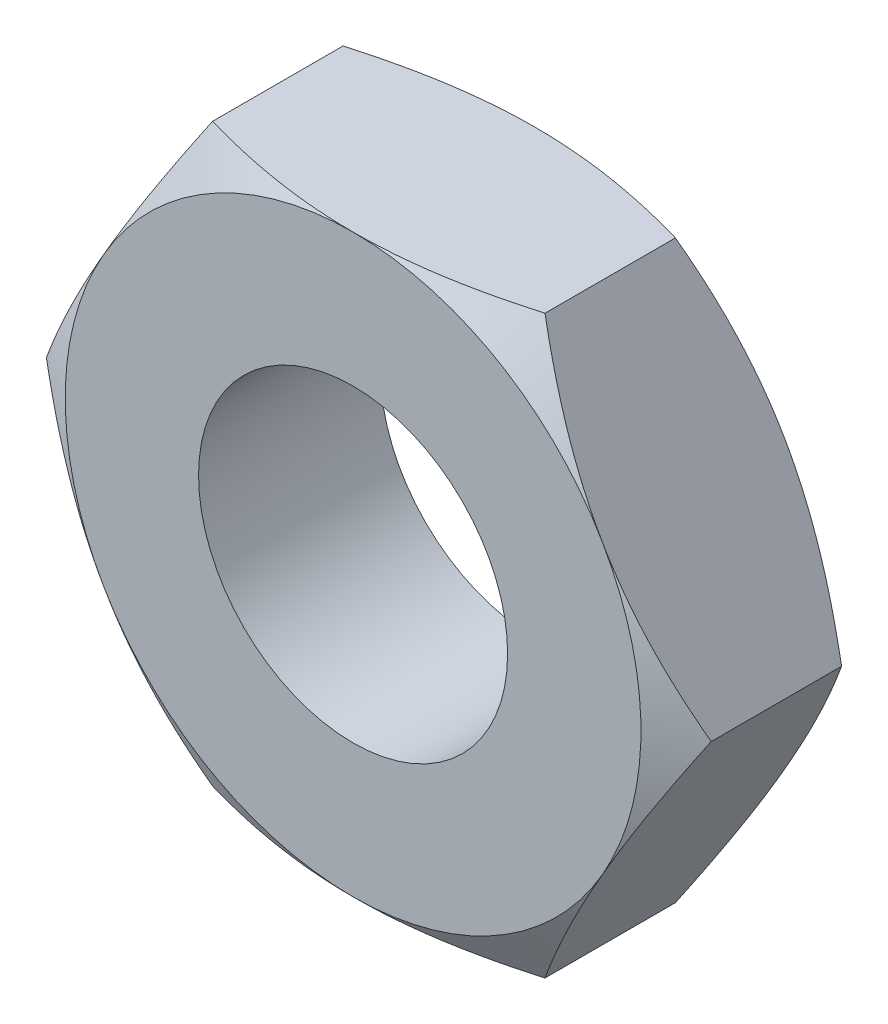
ISO-10303-21;
HEADER;
FILE_DESCRIPTION(('STEP AP214'),'2;1');
FILE_NAME('part.step','',(''),(''),'','','');
FILE_SCHEMA(('AUTOMOTIVE_DESIGN { 1 0 10303 214 1 1 1 1 }'));
ENDSEC;
DATA;
#1=APPLICATION_CONTEXT('core data for automotive mechanical design processes');
#2=APPLICATION_PROTOCOL_DEFINITION('international standard','automotive_design',2000,#1);
#3=PRODUCT_CONTEXT('',#1,'mechanical');
#4=PRODUCT('Part','Part','',(#3));
#5=PRODUCT_RELATED_PRODUCT_CATEGORY('part','',(#4));
#6=PRODUCT_DEFINITION_FORMATION('','',#4);
#7=PRODUCT_DEFINITION_CONTEXT('part definition',#1,'design');
#8=PRODUCT_DEFINITION('design','',#6,#7);
#9=PRODUCT_DEFINITION_SHAPE('','',#8);
#10=(LENGTH_UNIT() NAMED_UNIT(*) SI_UNIT(.MILLI.,.METRE.));
#11=(NAMED_UNIT(*) PLANE_ANGLE_UNIT() SI_UNIT($,.RADIAN.));
#12=(NAMED_UNIT(*) SI_UNIT($,.STERADIAN.) SOLID_ANGLE_UNIT());
#13=UNCERTAINTY_MEASURE_WITH_UNIT(LENGTH_MEASURE(1.E-05),#10,'distance_accuracy_value','');
#14=(GEOMETRIC_REPRESENTATION_CONTEXT(3) GLOBAL_UNCERTAINTY_ASSIGNED_CONTEXT((#13)) GLOBAL_UNIT_ASSIGNED_CONTEXT((#10,
#11,#12)) REPRESENTATION_CONTEXT('',''));
#15=CARTESIAN_POINT('',(0.,0.,0.));
#16=DIRECTION('',(0.,0.,1.));
#17=DIRECTION('',(1.,0.,0.));
#18=AXIS2_PLACEMENT_3D('',#15,#16,#17);
#19=CARTESIAN_POINT('',(-5.48482755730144,-9.5,6.));
#20=DIRECTION('',(0.,1.,0.));
#21=DIRECTION('',(-1.,0.,0.));
#22=AXIS2_PLACEMENT_3D('',#19,#20,#21);
#23=PLANE('',#22);
#24=DIRECTION('',(0.,0.,-1.));
#25=VECTOR('',#24,1.);
#26=CARTESIAN_POINT('',(-5.48482755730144,-9.5,6.));
#27=LINE('',#26,#25);
#28=CARTESIAN_POINT('',(-5.48482755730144,-9.5,5.15149422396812));
#29=VERTEX_POINT('',#28);
#30=CARTESIAN_POINT('',(-5.48482755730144,-9.5,0.848505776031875));
#31=VERTEX_POINT('',#30);
#32=EDGE_CURVE('E258',#29,#31,#27,.T.);
#33=ORIENTED_EDGE('',*,*,#32,.T.);
#34=CARTESIAN_POINT('',(-14.5465709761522,-9.49999999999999,4.54600370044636));
#35=CARTESIAN_POINT('',(-14.3380268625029,-9.49999999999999,4.44519656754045));
#36=CARTESIAN_POINT('',(-14.129230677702,-9.49999999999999,4.34491115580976));
#37=CARTESIAN_POINT('',(-13.7110809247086,-9.49999999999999,4.14550353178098));
#38=CARTESIAN_POINT('',(-13.5017273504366,-9.5,4.04638133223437));
#39=CARTESIAN_POINT('',(-12.8726893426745,-9.5,3.75091045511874));
#40=CARTESIAN_POINT('',(-12.4520954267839,-9.5,3.55649036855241));
#41=CARTESIAN_POINT('',(-11.6055942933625,-9.5,3.17293577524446));
#42=CARTESIAN_POINT('',(-11.1796704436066,-9.5,2.98383788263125));
#43=CARTESIAN_POINT('',(-10.3243227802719,-9.5,2.6137610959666));
#44=CARTESIAN_POINT('',(-9.89489915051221,-9.5,2.43278177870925));
#45=CARTESIAN_POINT('',(-9.0265367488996,-9.5,2.07895754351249));
#46=CARTESIAN_POINT('',(-8.58754588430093,-9.5,1.9062397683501));
#47=CARTESIAN_POINT('',(-7.70438743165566,-9.5,1.57433108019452));
#48=CARTESIAN_POINT('',(-7.26021927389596,-9.5,1.41514167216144));
#49=CARTESIAN_POINT('',(-6.36690631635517,-9.5,1.11456802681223));
#50=CARTESIAN_POINT('',(-5.91777439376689,-9.5,0.973145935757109));
#51=CARTESIAN_POINT('',(-5.01314169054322,-9.5,0.712697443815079));
#52=CARTESIAN_POINT('',(-4.55764297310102,-9.5,0.593663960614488));
#53=CARTESIAN_POINT('',(-3.6398894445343,-9.5,0.3837801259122));
#54=CARTESIAN_POINT('',(-3.17763286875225,-9.5,0.292937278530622));
#55=CARTESIAN_POINT('',(-2.48018032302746,-9.5,0.18236456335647));
#56=CARTESIAN_POINT('',(-2.24698958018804,-9.5,0.149786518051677));
#57=CARTESIAN_POINT('',(-1.77951479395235,-9.5,0.0938352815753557));
#58=CARTESIAN_POINT('',(-1.54523086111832,-9.5,0.0704611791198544));
#59=CARTESIAN_POINT('',(-1.07737258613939,-9.5,0.0335468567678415));
#60=CARTESIAN_POINT('',(-0.84380308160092,-9.5,0.0199455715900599));
#61=CARTESIAN_POINT('',(-0.376297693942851,-9.5,0.00264879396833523));
#62=CARTESIAN_POINT('',(-0.142361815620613,-9.5,-0.00104682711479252));
#63=CARTESIAN_POINT('',(0.325389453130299,-9.5,0.0015557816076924));
#64=CARTESIAN_POINT('',(0.559204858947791,-9.5,0.00785120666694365));
#65=CARTESIAN_POINT('',(1.02636653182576,-9.5,0.0302793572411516));
#66=CARTESIAN_POINT('',(1.25971277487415,-9.5,0.0464125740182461));
#67=CARTESIAN_POINT('',(1.82527222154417,-9.5,0.097100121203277));
#68=CARTESIAN_POINT('',(2.15705089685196,-9.5,0.136583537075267));
#69=CARTESIAN_POINT('',(2.81806585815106,-9.5,0.233246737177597));
#70=CARTESIAN_POINT('',(3.14730142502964,-9.5,0.290431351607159));
#71=CARTESIAN_POINT('',(3.80295855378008,-9.5,0.420468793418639));
#72=CARTESIAN_POINT('',(4.12937714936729,-9.5,0.493336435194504));
#73=CARTESIAN_POINT('',(4.77885595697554,-9.5,0.652516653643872));
#74=CARTESIAN_POINT('',(5.10191648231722,-9.5,0.738827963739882));
#75=CARTESIAN_POINT('',(5.75263605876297,-9.5,0.925086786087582));
#76=CARTESIAN_POINT('',(6.08021372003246,-9.5,1.02531669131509));
#77=CARTESIAN_POINT('',(6.73190653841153,-9.5,1.23567979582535));
#78=CARTESIAN_POINT('',(7.05602391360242,-9.5,1.34580616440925));
#79=CARTESIAN_POINT('',(7.69949559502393,-9.5,1.57368742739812));
#80=CARTESIAN_POINT('',(8.01886644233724,-9.5,1.69139589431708));
#81=CARTESIAN_POINT('',(8.65513026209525,-9.5,1.93372164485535));
#82=CARTESIAN_POINT('',(8.97202217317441,-9.5,2.05834172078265));
#83=CARTESIAN_POINT('',(9.28776285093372,-9.5,2.18573389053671));
#84=B_SPLINE_CURVE_WITH_KNOTS('',3,(#34,#35,#36,#37,#38,#39,#40,#41,#42,#43,#44,#45,#46,#47,#48,
#49,#50,#51,#52,#53,#54,#55,#56,#57,#58,#59,#60,#61,#62,#63,#64,#65,#66,#67,#68,#69,#70,#71,#72,
#73,#74,#75,#76,#77,#78,#79,#80,#81,#82,#83),.UNSPECIFIED.,.F.,.F.,(4,2,2,2,2,2,2,2,2,2,2,2,2,2,
2,2,2,2,2,2,2,2,2,2,4),(0.,0.694890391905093,1.38978839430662,2.77981043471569,4.17778700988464,
5.57569062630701,6.99075616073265,8.40597890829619,9.8181334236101,11.2298404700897,
12.6419229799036,13.3481360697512,14.0542792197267,14.7559707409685,15.4576531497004,
16.1591386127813,16.8606591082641,17.8624602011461,18.8645349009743,19.8675603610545,
20.870491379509,21.8980064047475,22.9248175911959,23.9458491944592,24.9672963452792),.UNSPECIFIED.);
#85=CARTESIAN_POINT('',(0.,-9.5,0.));
#86=VERTEX_POINT('',#85);
#87=EDGE_CURVE('E60',#31,#86,#84,.T.);
#88=ORIENTED_EDGE('',*,*,#87,.T.);
#89=CARTESIAN_POINT('',(5.48482755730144,-9.5,0.848505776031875));
#90=VERTEX_POINT('',#89);
#91=EDGE_CURVE('E214',#86,#90,#84,.T.);
#92=ORIENTED_EDGE('',*,*,#91,.T.);
#93=DIRECTION('',(0.,0.,-1.));
#94=VECTOR('',#93,1.);
#95=CARTESIAN_POINT('',(5.48482755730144,-9.5,6.));
#96=LINE('',#95,#94);
#97=CARTESIAN_POINT('',(5.48482755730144,-9.5,5.15149422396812));
#98=VERTEX_POINT('',#97);
#99=EDGE_CURVE('E275',#98,#90,#96,.T.);
#100=ORIENTED_EDGE('',*,*,#99,.F.);
#101=CARTESIAN_POINT('',(-14.5465709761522,-9.49999999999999,1.45399629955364));
#102=CARTESIAN_POINT('',(-14.3380268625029,-9.49999999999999,1.55480343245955));
#103=CARTESIAN_POINT('',(-14.129230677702,-9.49999999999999,1.65508884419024));
#104=CARTESIAN_POINT('',(-13.7110809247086,-9.49999999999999,1.85449646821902));
#105=CARTESIAN_POINT('',(-13.5017273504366,-9.5,1.95361866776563));
#106=CARTESIAN_POINT('',(-12.8726893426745,-9.5,2.24908954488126));
#107=CARTESIAN_POINT('',(-12.4520954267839,-9.5,2.44350963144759));
#108=CARTESIAN_POINT('',(-11.6055942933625,-9.5,2.82706422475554));
#109=CARTESIAN_POINT('',(-11.1796704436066,-9.5,3.01616211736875));
#110=CARTESIAN_POINT('',(-10.3243227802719,-9.5,3.3862389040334));
#111=CARTESIAN_POINT('',(-9.89489915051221,-9.5,3.56721822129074));
#112=CARTESIAN_POINT('',(-9.0265367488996,-9.5,3.92104245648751));
#113=CARTESIAN_POINT('',(-8.58754588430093,-9.5,4.0937602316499));
#114=CARTESIAN_POINT('',(-7.70438743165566,-9.5,4.42566891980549));
#115=CARTESIAN_POINT('',(-7.26021927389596,-9.5,4.58485832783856));
#116=CARTESIAN_POINT('',(-6.36690631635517,-9.5,4.88543197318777));
#117=CARTESIAN_POINT('',(-5.91777439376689,-9.5,5.02685406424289));
#118=CARTESIAN_POINT('',(-5.01314169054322,-9.5,5.28730255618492));
#119=CARTESIAN_POINT('',(-4.55764297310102,-9.5,5.40633603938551));
#120=CARTESIAN_POINT('',(-3.6398894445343,-9.5,5.6162198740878));
#121=CARTESIAN_POINT('',(-3.17763286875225,-9.5,5.70706272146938));
#122=CARTESIAN_POINT('',(-2.48018032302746,-9.5,5.81763543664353));
#123=CARTESIAN_POINT('',(-2.24698958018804,-9.5,5.85021348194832));
#124=CARTESIAN_POINT('',(-1.77951479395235,-9.5,5.90616471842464));
#125=CARTESIAN_POINT('',(-1.54523086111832,-9.5,5.92953882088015));
#126=CARTESIAN_POINT('',(-1.07737258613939,-9.5,5.96645314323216));
#127=CARTESIAN_POINT('',(-0.84380308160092,-9.5,5.98005442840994));
#128=CARTESIAN_POINT('',(-0.376297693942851,-9.5,5.99735120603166));
#129=CARTESIAN_POINT('',(-0.142361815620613,-9.5,6.00104682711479));
#130=CARTESIAN_POINT('',(0.325389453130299,-9.5,5.99844421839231));
#131=CARTESIAN_POINT('',(0.559204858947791,-9.5,5.99214879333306));
#132=CARTESIAN_POINT('',(1.02636653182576,-9.5,5.96972064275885));
#133=CARTESIAN_POINT('',(1.25971277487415,-9.5,5.95358742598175));
#134=CARTESIAN_POINT('',(1.82527222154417,-9.5,5.90289987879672));
#135=CARTESIAN_POINT('',(2.15705089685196,-9.5,5.86341646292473));
#136=CARTESIAN_POINT('',(2.81806585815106,-9.5,5.7667532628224));
#137=CARTESIAN_POINT('',(3.14730142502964,-9.5,5.70956864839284));
#138=CARTESIAN_POINT('',(3.80295855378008,-9.5,5.57953120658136));
#139=CARTESIAN_POINT('',(4.12937714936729,-9.5,5.5066635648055));
#140=CARTESIAN_POINT('',(4.77885595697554,-9.5,5.34748334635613));
#141=CARTESIAN_POINT('',(5.10191648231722,-9.5,5.26117203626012));
#142=CARTESIAN_POINT('',(5.75263605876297,-9.5,5.07491321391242));
#143=CARTESIAN_POINT('',(6.08021372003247,-9.5,4.97468330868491));
#144=CARTESIAN_POINT('',(6.73190653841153,-9.5,4.76432020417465));
#145=CARTESIAN_POINT('',(7.05602391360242,-9.5,4.65419383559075));
#146=CARTESIAN_POINT('',(7.69949559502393,-9.5,4.42631257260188));
#147=CARTESIAN_POINT('',(8.01886644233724,-9.5,4.30860410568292));
#148=CARTESIAN_POINT('',(8.65513026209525,-9.5,4.06627835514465));
#149=CARTESIAN_POINT('',(8.97202217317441,-9.5,3.94165827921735));
#150=CARTESIAN_POINT('',(9.28776285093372,-9.5,3.81426610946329));
#151=B_SPLINE_CURVE_WITH_KNOTS('',3,(#101,#102,#103,#104,#105,#106,#107,#108,#109,#110,#111,
#112,#113,#114,#115,#116,#117,#118,#119,#120,#121,#122,#123,#124,#125,#126,#127,#128,#129,#130,
#131,#132,#133,#134,#135,#136,#137,#138,#139,#140,#141,#142,#143,#144,#145,#146,#147,#148,#149,
#150),.UNSPECIFIED.,.F.,.F.,(4,2,2,2,2,2,2,2,2,2,2,2,2,2,2,2,2,2,2,2,2,2,2,2,4),(0.,
0.694890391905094,1.38978839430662,2.77981043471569,4.17778700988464,5.57569062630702,
6.99075616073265,8.40597890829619,9.8181334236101,11.2298404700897,12.6419229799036,
13.3481360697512,14.0542792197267,14.7559707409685,15.4576531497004,16.1591386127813,
16.8606591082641,17.8624602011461,18.8645349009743,19.8675603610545,20.870491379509,
21.8980064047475,22.9248175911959,23.9458491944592,24.9672963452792),.UNSPECIFIED.);
#152=CARTESIAN_POINT('',(0.,-9.5,6.));
#153=VERTEX_POINT('',#152);
#154=EDGE_CURVE('E328',#98,#153,#151,.F.);
#155=ORIENTED_EDGE('',*,*,#154,.T.);
#156=EDGE_CURVE('E323',#153,#29,#151,.F.);
#157=ORIENTED_EDGE('',*,*,#156,.T.);
#158=EDGE_LOOP('',(#33,#88,#92,#100,#155,#157));
#159=FACE_BOUND('',#158,.T.);
#160=ADVANCED_FACE('F37',(#159),#23,.F.);
#161=CARTESIAN_POINT('',(5.48482755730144,-9.5,6.));
#162=DIRECTION('',(-0.866025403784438,0.5,0.));
#163=DIRECTION('',(-0.5,-0.866025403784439,0.));
#164=AXIS2_PLACEMENT_3D('',#161,#162,#163);
#165=PLANE('',#164);
#166=ORIENTED_EDGE('',*,*,#99,.T.);
#167=CARTESIAN_POINT('',(5.48471208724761,-9.5002,0.848572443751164));
#168=CARTESIAN_POINT('',(5.6052805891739,-9.2913692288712,0.778973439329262));
#169=CARTESIAN_POINT('',(5.72629863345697,-9.08175982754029,0.712533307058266));
#170=CARTESIAN_POINT('',(5.96930519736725,-8.66086011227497,0.586847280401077));
#171=CARTESIAN_POINT('',(6.09129402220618,-8.44956926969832,0.527603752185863));
#172=CARTESIAN_POINT('',(6.45922610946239,-7.81229220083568,0.361814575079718));
#173=CARTESIAN_POINT('',(6.70662183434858,-7.38379023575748,0.267514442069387));
#174=CARTESIAN_POINT('',(7.07683821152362,-6.74255666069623,0.156938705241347));
#175=CARTESIAN_POINT('',(7.19855281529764,-6.53174078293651,0.125439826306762));
#176=CARTESIAN_POINT('',(7.44254555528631,-6.10913296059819,0.0726182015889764));
#177=CARTESIAN_POINT('',(7.56482370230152,-5.89734099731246,0.0512956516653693));
#178=CARTESIAN_POINT('',(7.80958396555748,-5.47340378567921,0.0193730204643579));
#179=CARTESIAN_POINT('',(7.93206566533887,-5.26125925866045,0.0087601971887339));
#180=CARTESIAN_POINT('',(8.17714220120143,-4.83677424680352,-0.0015174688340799));
#181=CARTESIAN_POINT('',(8.29973703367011,-4.62443376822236,-0.0011826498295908));
#182=CARTESIAN_POINT('',(8.5289310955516,-4.22745800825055,0.00967336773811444));
#183=CARTESIAN_POINT('',(8.63554650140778,-4.04279470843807,0.0188702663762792));
#184=CARTESIAN_POINT('',(8.84852796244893,-3.67389999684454,0.045365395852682));
#185=CARTESIAN_POINT('',(8.95489399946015,-3.48966861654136,0.0626641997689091));
#186=CARTESIAN_POINT('',(9.27357996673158,-2.937688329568,0.126304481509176));
#187=CARTESIAN_POINT('',(9.4853358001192,-2.57091646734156,0.18438190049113));
#188=CARTESIAN_POINT('',(9.91109368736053,-1.83348217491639,0.329576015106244));
#189=CARTESIAN_POINT('',(10.1250414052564,-1.46291385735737,0.417308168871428));
#190=CARTESIAN_POINT('',(10.5497463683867,-0.72730328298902,0.616423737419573));
#191=CARTESIAN_POINT('',(10.7605090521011,-0.362251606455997,0.727760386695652));
#192=CARTESIAN_POINT('',(10.9697705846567,0.000200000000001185,0.848572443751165));
#193=B_SPLINE_CURVE_WITH_KNOTS('',3,(#167,#168,#169,#170,#171,#172,#173,#174,#175,#176,#177,
#178,#179,#180,#181,#182,#183,#184,#185,#186,#187,#188,#189,#190,#191,#192),.UNSPECIFIED.,.F.,
.F.,(4,2,2,2,2,2,2,2,2,2,2,2,4),(0.,0.752880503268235,1.50600787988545,3.0154687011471,
3.75167336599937,4.48789219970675,5.22323407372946,5.95855322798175,6.59868084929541,
7.23885375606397,8.52010929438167,9.82978009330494,11.1368800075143),.UNSPECIFIED.);
#194=CARTESIAN_POINT('',(8.22724133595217,-4.75,0.));
#195=VERTEX_POINT('',#194);
#196=EDGE_CURVE('E212',#90,#195,#193,.T.);
#197=ORIENTED_EDGE('',*,*,#196,.T.);
#198=CARTESIAN_POINT('',(10.9696551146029,0.,0.848505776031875));
#199=VERTEX_POINT('',#198);
#200=EDGE_CURVE('E206',#195,#199,#193,.T.);
#201=ORIENTED_EDGE('',*,*,#200,.T.);
#202=DIRECTION('',(0.,0.,-1.));
#203=VECTOR('',#202,1.);
#204=CARTESIAN_POINT('',(10.9696551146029,0.,6.));
#205=LINE('',#204,#203);
#206=CARTESIAN_POINT('',(10.9696551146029,0.,5.15149422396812));
#207=VERTEX_POINT('',#206);
#208=EDGE_CURVE('E271',#207,#199,#205,.T.);
#209=ORIENTED_EDGE('',*,*,#208,.F.);
#210=CARTESIAN_POINT('',(10.9697705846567,0.000200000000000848,5.15142755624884));
#211=CARTESIAN_POINT('',(10.8492020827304,-0.208630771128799,5.22102656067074));
#212=CARTESIAN_POINT('',(10.7281840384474,-0.418240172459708,5.28746669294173));
#213=CARTESIAN_POINT('',(10.4851774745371,-0.839139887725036,5.41315271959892));
#214=CARTESIAN_POINT('',(10.3631886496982,-1.05043073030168,5.47239624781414));
#215=CARTESIAN_POINT('',(9.99525656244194,-1.68770779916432,5.63818542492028));
#216=CARTESIAN_POINT('',(9.74786083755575,-2.11620976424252,5.73248555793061));
#217=CARTESIAN_POINT('',(9.37764446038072,-2.75744333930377,5.84306129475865));
#218=CARTESIAN_POINT('',(9.2559298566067,-2.96825921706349,5.87456017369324));
#219=CARTESIAN_POINT('',(9.01193711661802,-3.39086703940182,5.92738179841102));
#220=CARTESIAN_POINT('',(8.88965896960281,-3.60265900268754,5.94870434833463));
#221=CARTESIAN_POINT('',(8.64489870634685,-4.02659621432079,5.98062697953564));
#222=CARTESIAN_POINT('',(8.52241700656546,-4.23874074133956,5.99123980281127));
#223=CARTESIAN_POINT('',(8.27734047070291,-4.66322575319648,6.00151746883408));
#224=CARTESIAN_POINT('',(8.15474563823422,-4.87556623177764,6.00118264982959));
#225=CARTESIAN_POINT('',(7.92555157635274,-5.27254199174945,5.99032663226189));
#226=CARTESIAN_POINT('',(7.81893617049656,-5.45720529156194,5.98112973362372));
#227=CARTESIAN_POINT('',(7.6059547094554,-5.82610000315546,5.95463460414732));
#228=CARTESIAN_POINT('',(7.49958867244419,-6.01033138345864,5.93733580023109));
#229=CARTESIAN_POINT('',(7.18090270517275,-6.56231167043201,5.87369551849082));
#230=CARTESIAN_POINT('',(6.96914687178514,-6.92908353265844,5.81561809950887));
#231=CARTESIAN_POINT('',(6.5433889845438,-7.66651782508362,5.67042398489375));
#232=CARTESIAN_POINT('',(6.32944126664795,-8.03708614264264,5.58269183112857));
#233=CARTESIAN_POINT('',(5.90473630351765,-8.77269671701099,5.38357626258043));
#234=CARTESIAN_POINT('',(5.69397361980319,-9.13774839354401,5.27223961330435));
#235=CARTESIAN_POINT('',(5.4847120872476,-9.5002,5.15142755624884));
#236=B_SPLINE_CURVE_WITH_KNOTS('',3,(#210,#211,#212,#213,#214,#215,#216,#217,#218,#219,#220,
#221,#222,#223,#224,#225,#226,#227,#228,#229,#230,#231,#232,#233,#234,#235),.UNSPECIFIED.,.F.,
.F.,(4,2,2,2,2,2,2,2,2,2,2,2,4),(0.,0.752880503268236,1.50600787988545,3.0154687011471,
3.75167336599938,4.48789219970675,5.22323407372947,5.95855322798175,6.59868084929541,
7.23885375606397,8.52010929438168,9.82978009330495,11.1368800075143),.UNSPECIFIED.);
#237=CARTESIAN_POINT('',(8.22724133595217,-4.75,6.));
#238=VERTEX_POINT('',#237);
#239=EDGE_CURVE('E235',#207,#238,#236,.T.);
#240=ORIENTED_EDGE('',*,*,#239,.T.);
#241=EDGE_CURVE('E227',#238,#98,#236,.T.);
#242=ORIENTED_EDGE('',*,*,#241,.T.);
#243=EDGE_LOOP('',(#166,#197,#201,#209,#240,#242));
#244=FACE_BOUND('',#243,.T.);
#245=ADVANCED_FACE('F219',(#244),#165,.F.);
#246=CARTESIAN_POINT('',(10.9696551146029,0.,6.));
#247=DIRECTION('',(-0.866025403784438,-0.5,0.));
#248=DIRECTION('',(0.5,-0.866025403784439,0.));
#249=AXIS2_PLACEMENT_3D('',#246,#247,#248);
#250=PLANE('',#249);
#251=ORIENTED_EDGE('',*,*,#208,.T.);
#252=CARTESIAN_POINT('',(10.9697705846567,-0.000199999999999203,0.848572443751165));
#253=CARTESIAN_POINT('',(10.8492020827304,0.208630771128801,0.778973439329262));
#254=CARTESIAN_POINT('',(10.7281840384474,0.418240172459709,0.712533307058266));
#255=CARTESIAN_POINT('',(10.4851774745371,0.839139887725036,0.586847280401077));
#256=CARTESIAN_POINT('',(10.3631886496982,1.05043073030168,0.527603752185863));
#257=CARTESIAN_POINT('',(9.99525656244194,1.68770779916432,0.361814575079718));
#258=CARTESIAN_POINT('',(9.74786083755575,2.11620976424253,0.267514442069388));
#259=CARTESIAN_POINT('',(9.37764446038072,2.75744333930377,0.156938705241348));
#260=CARTESIAN_POINT('',(9.2559298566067,2.96825921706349,0.125439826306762));
#261=CARTESIAN_POINT('',(9.01193711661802,3.39086703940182,0.0726182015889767));
#262=CARTESIAN_POINT('',(8.88965896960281,3.60265900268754,0.05129565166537));
#263=CARTESIAN_POINT('',(8.64489870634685,4.02659621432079,0.0193730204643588));
#264=CARTESIAN_POINT('',(8.52241700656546,4.23874074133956,0.00876019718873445));
#265=CARTESIAN_POINT('',(8.2773404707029,4.66322575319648,-0.00151746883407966));
#266=CARTESIAN_POINT('',(8.15474563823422,4.87556623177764,-0.00118264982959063));
#267=CARTESIAN_POINT('',(7.92555157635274,5.27254199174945,0.00967336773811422));
#268=CARTESIAN_POINT('',(7.81893617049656,5.45720529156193,0.0188702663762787));
#269=CARTESIAN_POINT('',(7.60595470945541,5.82610000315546,0.0453653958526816));
#270=CARTESIAN_POINT('',(7.49958867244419,6.01033138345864,0.0626641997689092));
#271=CARTESIAN_POINT('',(7.18090270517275,6.562311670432,0.126304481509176));
#272=CARTESIAN_POINT('',(6.96914687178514,6.92908353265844,0.184381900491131));
#273=CARTESIAN_POINT('',(6.5433889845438,7.66651782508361,0.329576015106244));
#274=CARTESIAN_POINT('',(6.32944126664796,8.03708614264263,0.417308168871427));
#275=CARTESIAN_POINT('',(5.90473630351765,8.77269671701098,0.616423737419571));
#276=CARTESIAN_POINT('',(5.69397361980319,9.137748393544,0.72776038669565));
#277=CARTESIAN_POINT('',(5.48471208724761,9.5002,0.848572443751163));
#278=B_SPLINE_CURVE_WITH_KNOTS('',3,(#252,#253,#254,#255,#256,#257,#258,#259,#260,#261,#262,
#263,#264,#265,#266,#267,#268,#269,#270,#271,#272,#273,#274,#275,#276,#277),.UNSPECIFIED.,.F.,
.F.,(4,2,2,2,2,2,2,2,2,2,2,2,4),(0.,0.752880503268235,1.50600787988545,3.0154687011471,
3.75167336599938,4.48789219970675,5.22323407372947,5.95855322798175,6.59868084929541,
7.23885375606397,8.52010929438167,9.82978009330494,11.1368800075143),.UNSPECIFIED.);
#279=CARTESIAN_POINT('',(8.22724133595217,4.75,0.));
#280=VERTEX_POINT('',#279);
#281=EDGE_CURVE('E213',#199,#280,#278,.T.);
#282=ORIENTED_EDGE('',*,*,#281,.T.);
#283=CARTESIAN_POINT('',(5.48482755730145,9.5,0.848505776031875));
#284=VERTEX_POINT('',#283);
#285=EDGE_CURVE('E200',#280,#284,#278,.T.);
#286=ORIENTED_EDGE('',*,*,#285,.T.);
#287=DIRECTION('',(0.,0.,-1.));
#288=VECTOR('',#287,1.);
#289=CARTESIAN_POINT('',(5.48482755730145,9.5,6.));
#290=LINE('',#289,#288);
#291=CARTESIAN_POINT('',(5.48482755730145,9.5,5.15149422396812));
#292=VERTEX_POINT('',#291);
#293=EDGE_CURVE('E267',#292,#284,#290,.T.);
#294=ORIENTED_EDGE('',*,*,#293,.F.);
#295=CARTESIAN_POINT('',(5.48471208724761,9.5002,5.15142755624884));
#296=CARTESIAN_POINT('',(5.6052805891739,9.2913692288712,5.22102656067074));
#297=CARTESIAN_POINT('',(5.72629863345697,9.08175982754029,5.28746669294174));
#298=CARTESIAN_POINT('',(5.96930519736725,8.66086011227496,5.41315271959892));
#299=CARTESIAN_POINT('',(6.09129402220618,8.44956926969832,5.47239624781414));
#300=CARTESIAN_POINT('',(6.45922610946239,7.81229220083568,5.63818542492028));
#301=CARTESIAN_POINT('',(6.70662183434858,7.38379023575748,5.73248555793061));
#302=CARTESIAN_POINT('',(7.07683821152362,6.74255666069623,5.84306129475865));
#303=CARTESIAN_POINT('',(7.19855281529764,6.53174078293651,5.87456017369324));
#304=CARTESIAN_POINT('',(7.44254555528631,6.10913296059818,5.92738179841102));
#305=CARTESIAN_POINT('',(7.56482370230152,5.89734099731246,5.94870434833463));
#306=CARTESIAN_POINT('',(7.80958396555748,5.47340378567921,5.98062697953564));
#307=CARTESIAN_POINT('',(7.93206566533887,5.26125925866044,5.99123980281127));
#308=CARTESIAN_POINT('',(8.17714220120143,4.83677424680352,6.00151746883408));
#309=CARTESIAN_POINT('',(8.29973703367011,4.62443376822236,6.00118264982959));
#310=CARTESIAN_POINT('',(8.5289310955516,4.22745800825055,5.99032663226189));
#311=CARTESIAN_POINT('',(8.63554650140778,4.04279470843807,5.98112973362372));
#312=CARTESIAN_POINT('',(8.84852796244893,3.67389999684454,5.95463460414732));
#313=CARTESIAN_POINT('',(8.95489399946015,3.48966861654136,5.93733580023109));
#314=CARTESIAN_POINT('',(9.27357996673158,2.937688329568,5.87369551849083));
#315=CARTESIAN_POINT('',(9.4853358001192,2.57091646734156,5.81561809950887));
#316=CARTESIAN_POINT('',(9.91109368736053,1.83348217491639,5.67042398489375));
#317=CARTESIAN_POINT('',(10.1250414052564,1.46291385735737,5.58269183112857));
#318=CARTESIAN_POINT('',(10.5497463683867,0.727303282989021,5.38357626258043));
#319=CARTESIAN_POINT('',(10.7605090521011,0.362251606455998,5.27223961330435));
#320=CARTESIAN_POINT('',(10.9697705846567,-0.000199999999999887,5.15142755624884));
#321=B_SPLINE_CURVE_WITH_KNOTS('',3,(#295,#296,#297,#298,#299,#300,#301,#302,#303,#304,#305,
#306,#307,#308,#309,#310,#311,#312,#313,#314,#315,#316,#317,#318,#319,#320),.UNSPECIFIED.,.F.,
.F.,(4,2,2,2,2,2,2,2,2,2,2,2,4),(0.,0.752880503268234,1.50600787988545,3.0154687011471,
3.75167336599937,4.48789219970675,5.22323407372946,5.95855322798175,6.5986808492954,
7.23885375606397,8.52010929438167,9.82978009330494,11.1368800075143),.UNSPECIFIED.);
#322=CARTESIAN_POINT('',(8.22724133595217,4.75,6.));
#323=VERTEX_POINT('',#322);
#324=EDGE_CURVE('E248',#292,#323,#321,.T.);
#325=ORIENTED_EDGE('',*,*,#324,.T.);
#326=EDGE_CURVE('E241',#323,#207,#321,.T.);
#327=ORIENTED_EDGE('',*,*,#326,.T.);
#328=EDGE_LOOP('',(#251,#282,#286,#294,#325,#327));
#329=FACE_BOUND('',#328,.T.);
#330=ADVANCED_FACE('F222',(#329),#250,.F.);
#331=CARTESIAN_POINT('',(5.48482755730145,9.5,6.));
#332=DIRECTION('',(0.,-1.,0.));
#333=DIRECTION('',(0.,0.,-1.));
#334=AXIS2_PLACEMENT_3D('',#331,#332,#333);
#335=PLANE('',#334);
#336=ORIENTED_EDGE('',*,*,#293,.T.);
#337=CARTESIAN_POINT('',(-14.5465709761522,9.5,4.54600370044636));
#338=CARTESIAN_POINT('',(-14.3380268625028,9.5,4.44519656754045));
#339=CARTESIAN_POINT('',(-14.129230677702,9.5,4.34491115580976));
#340=CARTESIAN_POINT('',(-13.7110809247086,9.5,4.14550353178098));
#341=CARTESIAN_POINT('',(-13.5017273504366,9.5,4.04638133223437));
#342=CARTESIAN_POINT('',(-12.8726893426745,9.5,3.75091045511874));
#343=CARTESIAN_POINT('',(-12.4520954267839,9.5,3.55649036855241));
#344=CARTESIAN_POINT('',(-11.6055942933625,9.5,3.17293577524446));
#345=CARTESIAN_POINT('',(-11.1796704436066,9.5,2.98383788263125));
#346=CARTESIAN_POINT('',(-10.3243227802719,9.5,2.6137610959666));
#347=CARTESIAN_POINT('',(-9.89489915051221,9.5,2.43278177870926));
#348=CARTESIAN_POINT('',(-9.0265367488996,9.5,2.07895754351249));
#349=CARTESIAN_POINT('',(-8.58754588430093,9.5,1.9062397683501));
#350=CARTESIAN_POINT('',(-7.70438743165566,9.5,1.57433108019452));
#351=CARTESIAN_POINT('',(-7.26021927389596,9.5,1.41514167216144));
#352=CARTESIAN_POINT('',(-6.36690631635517,9.5,1.11456802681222));
#353=CARTESIAN_POINT('',(-5.91777439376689,9.5,0.973145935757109));
#354=CARTESIAN_POINT('',(-5.01314169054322,9.5,0.712697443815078));
#355=CARTESIAN_POINT('',(-4.55764297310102,9.5,0.593663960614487));
#356=CARTESIAN_POINT('',(-3.6398894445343,9.5,0.383780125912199));
#357=CARTESIAN_POINT('',(-3.17763286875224,9.5,0.292937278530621));
#358=CARTESIAN_POINT('',(-2.48018032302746,9.5,0.182364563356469));
#359=CARTESIAN_POINT('',(-2.24698958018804,9.5,0.149786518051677));
#360=CARTESIAN_POINT('',(-1.77951479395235,9.5,0.0938352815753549));
#361=CARTESIAN_POINT('',(-1.54523086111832,9.5,0.0704611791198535));
#362=CARTESIAN_POINT('',(-1.07737258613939,9.5,0.0335468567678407));
#363=CARTESIAN_POINT('',(-0.843803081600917,9.5,0.0199455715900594));
#364=CARTESIAN_POINT('',(-0.376297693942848,9.5,0.00264879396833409));
#365=CARTESIAN_POINT('',(-0.142361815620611,9.5,-0.00104682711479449));
#366=CARTESIAN_POINT('',(0.325389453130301,9.5,0.00155578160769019));
#367=CARTESIAN_POINT('',(0.559204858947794,9.5,0.00785120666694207));
#368=CARTESIAN_POINT('',(1.02636653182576,9.5,0.0302793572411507));
#369=CARTESIAN_POINT('',(1.25971277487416,9.5,0.0464125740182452));
#370=CARTESIAN_POINT('',(1.82527222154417,9.5,0.0971001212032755));
#371=CARTESIAN_POINT('',(2.15705089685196,9.5,0.136583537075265));
#372=CARTESIAN_POINT('',(2.81806585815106,9.5,0.233246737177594));
#373=CARTESIAN_POINT('',(3.14730142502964,9.5,0.290431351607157));
#374=CARTESIAN_POINT('',(3.80295855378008,9.5,0.420468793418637));
#375=CARTESIAN_POINT('',(4.12937714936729,9.5,0.493336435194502));
#376=CARTESIAN_POINT('',(4.77885595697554,9.5,0.652516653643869));
#377=CARTESIAN_POINT('',(5.10191648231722,9.5,0.738827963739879));
#378=CARTESIAN_POINT('',(5.75263605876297,9.5,0.925086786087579));
#379=CARTESIAN_POINT('',(6.08021372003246,9.5,1.02531669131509));
#380=CARTESIAN_POINT('',(6.73190653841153,9.5,1.23567979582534));
#381=CARTESIAN_POINT('',(7.05602391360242,9.5,1.34580616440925));
#382=CARTESIAN_POINT('',(7.69949559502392,9.5,1.57368742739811));
#383=CARTESIAN_POINT('',(8.01886644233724,9.5,1.69139589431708));
#384=CARTESIAN_POINT('',(8.65513026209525,9.5,1.93372164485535));
#385=CARTESIAN_POINT('',(8.97202217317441,9.5,2.05834172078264));
#386=CARTESIAN_POINT('',(9.28776285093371,9.5,2.18573389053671));
#387=B_SPLINE_CURVE_WITH_KNOTS('',3,(#337,#338,#339,#340,#341,#342,#343,#344,#345,#346,#347,
#348,#349,#350,#351,#352,#353,#354,#355,#356,#357,#358,#359,#360,#361,#362,#363,#364,#365,#366,
#367,#368,#369,#370,#371,#372,#373,#374,#375,#376,#377,#378,#379,#380,#381,#382,#383,#384,#385,
#386),.UNSPECIFIED.,.F.,.F.,(4,2,2,2,2,2,2,2,2,2,2,2,2,2,2,2,2,2,2,2,2,2,2,2,4),(0.,
0.694890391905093,1.38978839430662,2.77981043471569,4.17778700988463,5.57569062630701,
6.99075616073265,8.40597890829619,9.8181334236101,11.2298404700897,12.6419229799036,
13.3481360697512,14.0542792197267,14.7559707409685,15.4576531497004,16.1591386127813,
16.8606591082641,17.8624602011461,18.8645349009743,19.8675603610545,20.870491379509,
21.8980064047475,22.9248175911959,23.9458491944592,24.9672963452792),.UNSPECIFIED.);
#388=CARTESIAN_POINT('',(0.,9.5,0.));
#389=VERTEX_POINT('',#388);
#390=EDGE_CURVE('E168',#284,#389,#387,.F.);
#391=ORIENTED_EDGE('',*,*,#390,.T.);
#392=CARTESIAN_POINT('',(-5.48482755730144,9.5,0.848505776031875));
#393=VERTEX_POINT('',#392);
#394=EDGE_CURVE('E147',#389,#393,#387,.F.);
#395=ORIENTED_EDGE('',*,*,#394,.T.);
#396=DIRECTION('',(0.,0.,-1.));
#397=VECTOR('',#396,1.);
#398=CARTESIAN_POINT('',(-5.48482755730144,9.5,6.));
#399=LINE('',#398,#397);
#400=CARTESIAN_POINT('',(-5.48482755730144,9.5,5.15149422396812));
#401=VERTEX_POINT('',#400);
#402=EDGE_CURVE('E163',#401,#393,#399,.T.);
#403=ORIENTED_EDGE('',*,*,#402,.F.);
#404=CARTESIAN_POINT('',(-14.5465709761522,9.5,1.45399629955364));
#405=CARTESIAN_POINT('',(-14.3380268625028,9.5,1.55480343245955));
#406=CARTESIAN_POINT('',(-14.129230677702,9.5,1.65508884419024));
#407=CARTESIAN_POINT('',(-13.7110809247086,9.5,1.85449646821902));
#408=CARTESIAN_POINT('',(-13.5017273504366,9.5,1.95361866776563));
#409=CARTESIAN_POINT('',(-12.8726893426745,9.5,2.24908954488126));
#410=CARTESIAN_POINT('',(-12.4520954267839,9.5,2.44350963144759));
#411=CARTESIAN_POINT('',(-11.6055942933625,9.5,2.82706422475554));
#412=CARTESIAN_POINT('',(-11.1796704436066,9.5,3.01616211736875));
#413=CARTESIAN_POINT('',(-10.3243227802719,9.5,3.3862389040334));
#414=CARTESIAN_POINT('',(-9.89489915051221,9.5,3.56721822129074));
#415=CARTESIAN_POINT('',(-9.0265367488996,9.5,3.92104245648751));
#416=CARTESIAN_POINT('',(-8.58754588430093,9.5,4.0937602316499));
#417=CARTESIAN_POINT('',(-7.70438743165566,9.5,4.42566891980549));
#418=CARTESIAN_POINT('',(-7.26021927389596,9.5,4.58485832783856));
#419=CARTESIAN_POINT('',(-6.36690631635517,9.5,4.88543197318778));
#420=CARTESIAN_POINT('',(-5.91777439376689,9.5,5.02685406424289));
#421=CARTESIAN_POINT('',(-5.01314169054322,9.5,5.28730255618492));
#422=CARTESIAN_POINT('',(-4.55764297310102,9.5,5.40633603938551));
#423=CARTESIAN_POINT('',(-3.6398894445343,9.5,5.6162198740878));
#424=CARTESIAN_POINT('',(-3.17763286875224,9.5,5.70706272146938));
#425=CARTESIAN_POINT('',(-2.48018032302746,9.5,5.81763543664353));
#426=CARTESIAN_POINT('',(-2.24698958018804,9.5,5.85021348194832));
#427=CARTESIAN_POINT('',(-1.77951479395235,9.5,5.90616471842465));
#428=CARTESIAN_POINT('',(-1.54523086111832,9.5,5.92953882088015));
#429=CARTESIAN_POINT('',(-1.07737258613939,9.5,5.96645314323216));
#430=CARTESIAN_POINT('',(-0.843803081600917,9.5,5.98005442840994));
#431=CARTESIAN_POINT('',(-0.376297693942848,9.5,5.99735120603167));
#432=CARTESIAN_POINT('',(-0.142361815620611,9.5,6.00104682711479));
#433=CARTESIAN_POINT('',(0.325389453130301,9.5,5.99844421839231));
#434=CARTESIAN_POINT('',(0.559204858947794,9.5,5.99214879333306));
#435=CARTESIAN_POINT('',(1.02636653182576,9.5,5.96972064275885));
#436=CARTESIAN_POINT('',(1.25971277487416,9.5,5.95358742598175));
#437=CARTESIAN_POINT('',(1.82527222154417,9.5,5.90289987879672));
#438=CARTESIAN_POINT('',(2.15705089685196,9.5,5.86341646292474));
#439=CARTESIAN_POINT('',(2.81806585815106,9.5,5.76675326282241));
#440=CARTESIAN_POINT('',(3.14730142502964,9.5,5.70956864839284));
#441=CARTESIAN_POINT('',(3.80295855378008,9.5,5.57953120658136));
#442=CARTESIAN_POINT('',(4.12937714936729,9.5,5.5066635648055));
#443=CARTESIAN_POINT('',(4.77885595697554,9.5,5.34748334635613));
#444=CARTESIAN_POINT('',(5.10191648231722,9.5,5.26117203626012));
#445=CARTESIAN_POINT('',(5.75263605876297,9.5,5.07491321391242));
#446=CARTESIAN_POINT('',(6.08021372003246,9.5,4.97468330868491));
#447=CARTESIAN_POINT('',(6.73190653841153,9.5,4.76432020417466));
#448=CARTESIAN_POINT('',(7.05602391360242,9.5,4.65419383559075));
#449=CARTESIAN_POINT('',(7.69949559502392,9.5,4.42631257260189));
#450=CARTESIAN_POINT('',(8.01886644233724,9.5,4.30860410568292));
#451=CARTESIAN_POINT('',(8.65513026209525,9.5,4.06627835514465));
#452=CARTESIAN_POINT('',(8.97202217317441,9.5,3.94165827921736));
#453=CARTESIAN_POINT('',(9.28776285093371,9.5,3.81426610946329));
#454=B_SPLINE_CURVE_WITH_KNOTS('',3,(#404,#405,#406,#407,#408,#409,#410,#411,#412,#413,#414,
#415,#416,#417,#418,#419,#420,#421,#422,#423,#424,#425,#426,#427,#428,#429,#430,#431,#432,#433,
#434,#435,#436,#437,#438,#439,#440,#441,#442,#443,#444,#445,#446,#447,#448,#449,#450,#451,#452,
#453),.UNSPECIFIED.,.F.,.F.,(4,2,2,2,2,2,2,2,2,2,2,2,2,2,2,2,2,2,2,2,2,2,2,2,4),(0.,
0.694890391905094,1.38978839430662,2.77981043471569,4.17778700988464,5.57569062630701,
6.99075616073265,8.40597890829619,9.8181334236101,11.2298404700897,12.6419229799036,
13.3481360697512,14.0542792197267,14.7559707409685,15.4576531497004,16.1591386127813,
16.8606591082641,17.8624602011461,18.8645349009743,19.8675603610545,20.870491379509,
21.8980064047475,22.9248175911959,23.9458491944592,24.9672963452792),.UNSPECIFIED.);
#455=CARTESIAN_POINT('',(0.,9.5,6.));
#456=VERTEX_POINT('',#455);
#457=EDGE_CURVE('E236',#401,#456,#454,.T.);
#458=ORIENTED_EDGE('',*,*,#457,.T.);
#459=EDGE_CURVE('E249',#456,#292,#454,.T.);
#460=ORIENTED_EDGE('',*,*,#459,.T.);
#461=EDGE_LOOP('',(#336,#391,#395,#403,#458,#460));
#462=FACE_BOUND('',#461,.T.);
#463=ADVANCED_FACE('F354',(#462),#335,.F.);
#464=CARTESIAN_POINT('',(-5.48482755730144,9.5,6.));
#465=DIRECTION('',(0.866025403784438,-0.5,0.));
#466=DIRECTION('',(0.5,0.866025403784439,0.));
#467=AXIS2_PLACEMENT_3D('',#464,#465,#466);
#468=PLANE('',#467);
#469=ORIENTED_EDGE('',*,*,#402,.T.);
#470=CARTESIAN_POINT('',(-5.4847120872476,9.5002,0.848572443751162));
#471=CARTESIAN_POINT('',(-5.60528058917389,9.2913692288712,0.778973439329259));
#472=CARTESIAN_POINT('',(-5.72629863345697,9.08175982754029,0.712533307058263));
#473=CARTESIAN_POINT('',(-5.96930519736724,8.66086011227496,0.586847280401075));
#474=CARTESIAN_POINT('',(-6.09129402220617,8.44956926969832,0.527603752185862));
#475=CARTESIAN_POINT('',(-6.45922610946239,7.81229220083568,0.361814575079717));
#476=CARTESIAN_POINT('',(-6.70662183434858,7.38379023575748,0.267514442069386));
#477=CARTESIAN_POINT('',(-7.07683821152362,6.74255666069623,0.156938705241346));
#478=CARTESIAN_POINT('',(-7.19855281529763,6.53174078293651,0.12543982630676));
#479=CARTESIAN_POINT('',(-7.44254555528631,6.10913296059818,0.0726182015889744));
#480=CARTESIAN_POINT('',(-7.56482370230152,5.89734099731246,0.0512956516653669));
#481=CARTESIAN_POINT('',(-7.80958396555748,5.47340378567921,0.0193730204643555));
#482=CARTESIAN_POINT('',(-7.93206566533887,5.26125925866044,0.00876019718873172));
#483=CARTESIAN_POINT('',(-8.17714220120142,4.83677424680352,-0.00151746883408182));
#484=CARTESIAN_POINT('',(-8.29973703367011,4.62443376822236,-0.00118264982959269));
#485=CARTESIAN_POINT('',(-8.52893109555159,4.22745800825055,0.00967336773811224));
#486=CARTESIAN_POINT('',(-8.63554650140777,4.04279470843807,0.0188702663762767));
#487=CARTESIAN_POINT('',(-8.84852796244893,3.67389999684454,0.0453653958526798));
#488=CARTESIAN_POINT('',(-8.95489399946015,3.48966861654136,0.0626641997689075));
#489=CARTESIAN_POINT('',(-9.27357996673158,2.937688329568,0.126304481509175));
#490=CARTESIAN_POINT('',(-9.48533580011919,2.57091646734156,0.184381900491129));
#491=CARTESIAN_POINT('',(-9.91109368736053,1.83348217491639,0.329576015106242));
#492=CARTESIAN_POINT('',(-10.1250414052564,1.46291385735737,0.417308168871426));
#493=CARTESIAN_POINT('',(-10.5497463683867,0.72730328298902,0.616423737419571));
#494=CARTESIAN_POINT('',(-10.7605090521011,0.362251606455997,0.727760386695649));
#495=CARTESIAN_POINT('',(-10.9697705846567,-0.000200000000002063,0.848572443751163));
#496=B_SPLINE_CURVE_WITH_KNOTS('',3,(#470,#471,#472,#473,#474,#475,#476,#477,#478,#479,#480,
#481,#482,#483,#484,#485,#486,#487,#488,#489,#490,#491,#492,#493,#494,#495),.UNSPECIFIED.,.F.,
.F.,(4,2,2,2,2,2,2,2,2,2,2,2,4),(0.,0.752880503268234,1.50600787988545,3.0154687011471,
3.75167336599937,4.48789219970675,5.22323407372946,5.95855322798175,6.59868084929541,
7.23885375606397,8.52010929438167,9.82978009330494,11.1368800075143),.UNSPECIFIED.);
#497=CARTESIAN_POINT('',(-8.22724133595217,4.75,0.));
#498=VERTEX_POINT('',#497);
#499=EDGE_CURVE('E140',#393,#498,#496,.T.);
#500=ORIENTED_EDGE('',*,*,#499,.T.);
#501=CARTESIAN_POINT('',(-10.9696551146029,0.,0.848505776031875));
#502=VERTEX_POINT('',#501);
#503=EDGE_CURVE('E127',#498,#502,#496,.T.);
#504=ORIENTED_EDGE('',*,*,#503,.T.);
#505=DIRECTION('',(0.,0.,-1.));
#506=VECTOR('',#505,1.);
#507=CARTESIAN_POINT('',(-10.9696551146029,0.,6.));
#508=LINE('',#507,#506);
#509=CARTESIAN_POINT('',(-10.9696551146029,0.,5.15149422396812));
#510=VERTEX_POINT('',#509);
#511=EDGE_CURVE('E262',#510,#502,#508,.T.);
#512=ORIENTED_EDGE('',*,*,#511,.F.);
#513=CARTESIAN_POINT('',(-10.9697705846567,-0.000200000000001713,5.15142755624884));
#514=CARTESIAN_POINT('',(-10.8492020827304,0.208630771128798,5.22102656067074));
#515=CARTESIAN_POINT('',(-10.7281840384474,0.418240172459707,5.28746669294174));
#516=CARTESIAN_POINT('',(-10.4851774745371,0.839139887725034,5.41315271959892));
#517=CARTESIAN_POINT('',(-10.3631886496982,1.05043073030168,5.47239624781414));
#518=CARTESIAN_POINT('',(-9.99525656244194,1.68770779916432,5.63818542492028));
#519=CARTESIAN_POINT('',(-9.74786083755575,2.11620976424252,5.73248555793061));
#520=CARTESIAN_POINT('',(-9.37764446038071,2.75744333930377,5.84306129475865));
#521=CARTESIAN_POINT('',(-9.2559298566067,2.96825921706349,5.87456017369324));
#522=CARTESIAN_POINT('',(-9.01193711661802,3.39086703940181,5.92738179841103));
#523=CARTESIAN_POINT('',(-8.88965896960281,3.60265900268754,5.94870434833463));
#524=CARTESIAN_POINT('',(-8.64489870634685,4.02659621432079,5.98062697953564));
#525=CARTESIAN_POINT('',(-8.52241700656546,4.23874074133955,5.99123980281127));
#526=CARTESIAN_POINT('',(-8.2773404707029,4.66322575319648,6.00151746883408));
#527=CARTESIAN_POINT('',(-8.15474563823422,4.87556623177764,6.00118264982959));
#528=CARTESIAN_POINT('',(-7.92555157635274,5.27254199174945,5.99032663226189));
#529=CARTESIAN_POINT('',(-7.81893617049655,5.45720529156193,5.98112973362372));
#530=CARTESIAN_POINT('',(-7.6059547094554,5.82610000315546,5.95463460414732));
#531=CARTESIAN_POINT('',(-7.49958867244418,6.01033138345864,5.93733580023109));
#532=CARTESIAN_POINT('',(-7.18090270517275,6.562311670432,5.87369551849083));
#533=CARTESIAN_POINT('',(-6.96914687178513,6.92908353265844,5.81561809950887));
#534=CARTESIAN_POINT('',(-6.5433889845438,7.66651782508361,5.67042398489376));
#535=CARTESIAN_POINT('',(-6.32944126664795,8.03708614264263,5.58269183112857));
#536=CARTESIAN_POINT('',(-5.90473630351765,8.77269671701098,5.38357626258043));
#537=CARTESIAN_POINT('',(-5.69397361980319,9.137748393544,5.27223961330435));
#538=CARTESIAN_POINT('',(-5.4847120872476,9.5002,5.15142755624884));
#539=B_SPLINE_CURVE_WITH_KNOTS('',3,(#513,#514,#515,#516,#517,#518,#519,#520,#521,#522,#523,
#524,#525,#526,#527,#528,#529,#530,#531,#532,#533,#534,#535,#536,#537,#538),.UNSPECIFIED.,.F.,
.F.,(4,2,2,2,2,2,2,2,2,2,2,2,4),(0.,0.752880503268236,1.50600787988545,3.0154687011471,
3.75167336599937,4.48789219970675,5.22323407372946,5.95855322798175,6.59868084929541,
7.23885375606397,8.52010929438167,9.82978009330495,11.1368800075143),.UNSPECIFIED.);
#540=CARTESIAN_POINT('',(-8.22724133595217,4.75,6.));
#541=VERTEX_POINT('',#540);
#542=EDGE_CURVE('E308',#510,#541,#539,.T.);
#543=ORIENTED_EDGE('',*,*,#542,.T.);
#544=EDGE_CURVE('E321',#541,#401,#539,.T.);
#545=ORIENTED_EDGE('',*,*,#544,.T.);
#546=EDGE_LOOP('',(#469,#500,#504,#512,#543,#545));
#547=FACE_BOUND('',#546,.T.);
#548=ADVANCED_FACE('F160',(#547),#468,.F.);
#549=CARTESIAN_POINT('',(-10.9696551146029,0.,6.));
#550=DIRECTION('',(0.866025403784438,0.5,0.));
#551=DIRECTION('',(-0.5,0.866025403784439,0.));
#552=AXIS2_PLACEMENT_3D('',#549,#550,#551);
#553=PLANE('',#552);
#554=ORIENTED_EDGE('',*,*,#511,.T.);
#555=CARTESIAN_POINT('',(-10.9697705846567,0.000199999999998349,0.848572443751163));
#556=CARTESIAN_POINT('',(-10.8492020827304,-0.208630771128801,0.77897343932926));
#557=CARTESIAN_POINT('',(-10.7281840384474,-0.41824017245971,0.712533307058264));
#558=CARTESIAN_POINT('',(-10.4851774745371,-0.839139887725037,0.586847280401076));
#559=CARTESIAN_POINT('',(-10.3631886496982,-1.05043073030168,0.527603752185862));
#560=CARTESIAN_POINT('',(-9.99525656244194,-1.68770779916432,0.361814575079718));
#561=CARTESIAN_POINT('',(-9.74786083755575,-2.11620976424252,0.267514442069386));
#562=CARTESIAN_POINT('',(-9.37764446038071,-2.75744333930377,0.156938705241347));
#563=CARTESIAN_POINT('',(-9.2559298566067,-2.96825921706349,0.125439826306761));
#564=CARTESIAN_POINT('',(-9.01193711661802,-3.39086703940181,0.0726182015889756));
#565=CARTESIAN_POINT('',(-8.88965896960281,-3.60265900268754,0.0512956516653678));
#566=CARTESIAN_POINT('',(-8.64489870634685,-4.02659621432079,0.0193730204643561));
#567=CARTESIAN_POINT('',(-8.52241700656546,-4.23874074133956,0.00876019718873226));
#568=CARTESIAN_POINT('',(-8.2773404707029,-4.66322575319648,-0.00151746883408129));
#569=CARTESIAN_POINT('',(-8.15474563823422,-4.87556623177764,-0.00118264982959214));
#570=CARTESIAN_POINT('',(-7.92555157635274,-5.27254199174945,0.00967336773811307));
#571=CARTESIAN_POINT('',(-7.81893617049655,-5.45720529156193,0.0188702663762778));
#572=CARTESIAN_POINT('',(-7.6059547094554,-5.82610000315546,0.0453653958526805));
#573=CARTESIAN_POINT('',(-7.49958867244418,-6.01033138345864,0.0626641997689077));
#574=CARTESIAN_POINT('',(-7.18090270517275,-6.562311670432,0.126304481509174));
#575=CARTESIAN_POINT('',(-6.96914687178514,-6.92908353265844,0.184381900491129));
#576=CARTESIAN_POINT('',(-6.5433889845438,-7.66651782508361,0.329576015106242));
#577=CARTESIAN_POINT('',(-6.32944126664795,-8.03708614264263,0.417308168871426));
#578=CARTESIAN_POINT('',(-5.90473630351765,-8.77269671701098,0.616423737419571));
#579=CARTESIAN_POINT('',(-5.69397361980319,-9.137748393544,0.72776038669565));
#580=CARTESIAN_POINT('',(-5.4847120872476,-9.5002,0.848572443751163));
#581=B_SPLINE_CURVE_WITH_KNOTS('',3,(#555,#556,#557,#558,#559,#560,#561,#562,#563,#564,#565,
#566,#567,#568,#569,#570,#571,#572,#573,#574,#575,#576,#577,#578,#579,#580),.UNSPECIFIED.,.F.,
.F.,(4,2,2,2,2,2,2,2,2,2,2,2,4),(0.,0.752880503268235,1.50600787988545,3.0154687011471,
3.75167336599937,4.48789219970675,5.22323407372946,5.95855322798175,6.5986808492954,
7.23885375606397,8.52010929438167,9.82978009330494,11.1368800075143),.UNSPECIFIED.);
#582=CARTESIAN_POINT('',(-8.22724133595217,-4.75,0.));
#583=VERTEX_POINT('',#582);
#584=EDGE_CURVE('E134',#502,#583,#581,.T.);
#585=ORIENTED_EDGE('',*,*,#584,.T.);
#586=EDGE_CURVE('E153',#583,#31,#581,.T.);
#587=ORIENTED_EDGE('',*,*,#586,.T.);
#588=ORIENTED_EDGE('',*,*,#32,.F.);
#589=CARTESIAN_POINT('',(-5.4847120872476,-9.5002,5.15142755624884));
#590=CARTESIAN_POINT('',(-5.60528058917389,-9.2913692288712,5.22102656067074));
#591=CARTESIAN_POINT('',(-5.72629863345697,-9.08175982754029,5.28746669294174));
#592=CARTESIAN_POINT('',(-5.96930519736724,-8.66086011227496,5.41315271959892));
#593=CARTESIAN_POINT('',(-6.09129402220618,-8.44956926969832,5.47239624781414));
#594=CARTESIAN_POINT('',(-6.45922610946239,-7.81229220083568,5.63818542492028));
#595=CARTESIAN_POINT('',(-6.70662183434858,-7.38379023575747,5.73248555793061));
#596=CARTESIAN_POINT('',(-7.07683821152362,-6.74255666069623,5.84306129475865));
#597=CARTESIAN_POINT('',(-7.19855281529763,-6.53174078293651,5.87456017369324));
#598=CARTESIAN_POINT('',(-7.44254555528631,-6.10913296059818,5.92738179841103));
#599=CARTESIAN_POINT('',(-7.56482370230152,-5.89734099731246,5.94870434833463));
#600=CARTESIAN_POINT('',(-7.80958396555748,-5.47340378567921,5.98062697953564));
#601=CARTESIAN_POINT('',(-7.93206566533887,-5.26125925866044,5.99123980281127));
#602=CARTESIAN_POINT('',(-8.17714220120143,-4.83677424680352,6.00151746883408));
#603=CARTESIAN_POINT('',(-8.29973703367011,-4.62443376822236,6.00118264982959));
#604=CARTESIAN_POINT('',(-8.5289310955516,-4.22745800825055,5.99032663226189));
#605=CARTESIAN_POINT('',(-8.63554650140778,-4.04279470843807,5.98112973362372));
#606=CARTESIAN_POINT('',(-8.84852796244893,-3.67389999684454,5.95463460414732));
#607=CARTESIAN_POINT('',(-8.95489399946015,-3.48966861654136,5.93733580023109));
#608=CARTESIAN_POINT('',(-9.27357996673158,-2.937688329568,5.87369551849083));
#609=CARTESIAN_POINT('',(-9.48533580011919,-2.57091646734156,5.81561809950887));
#610=CARTESIAN_POINT('',(-9.91109368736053,-1.83348217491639,5.67042398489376));
#611=CARTESIAN_POINT('',(-10.1250414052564,-1.46291385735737,5.58269183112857));
#612=CARTESIAN_POINT('',(-10.5497463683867,-0.727303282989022,5.38357626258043));
#613=CARTESIAN_POINT('',(-10.7605090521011,-0.362251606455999,5.27223961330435));
#614=CARTESIAN_POINT('',(-10.9697705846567,0.000199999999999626,5.15142755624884));
#615=B_SPLINE_CURVE_WITH_KNOTS('',3,(#589,#590,#591,#592,#593,#594,#595,#596,#597,#598,#599,
#600,#601,#602,#603,#604,#605,#606,#607,#608,#609,#610,#611,#612,#613,#614),.UNSPECIFIED.,.F.,
.F.,(4,2,2,2,2,2,2,2,2,2,2,2,4),(0.,0.752880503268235,1.50600787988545,3.0154687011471,
3.75167336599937,4.48789219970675,5.22323407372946,5.95855322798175,6.5986808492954,
7.23885375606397,8.52010929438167,9.82978009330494,11.1368800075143),.UNSPECIFIED.);
#616=CARTESIAN_POINT('',(-8.22724133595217,-4.75,6.));
#617=VERTEX_POINT('',#616);
#618=EDGE_CURVE('E324',#29,#617,#615,.T.);
#619=ORIENTED_EDGE('',*,*,#618,.T.);
#620=EDGE_CURVE('E310',#617,#510,#615,.T.);
#621=ORIENTED_EDGE('',*,*,#620,.T.);
#622=EDGE_LOOP('',(#554,#585,#587,#588,#619,#621));
#623=FACE_BOUND('',#622,.T.);
#624=ADVANCED_FACE('F371',(#623),#553,.F.);
#625=CARTESIAN_POINT('',(5.48482755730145,-9.5,6.));
#626=DIRECTION('',(0.,0.,1.));
#627=DIRECTION('',(1.,0.,0.));
#628=AXIS2_PLACEMENT_3D('',#625,#626,#627);
#629=PLANE('',#628);
#630=CARTESIAN_POINT('',(0.,0.,6.));
#631=DIRECTION('',(0.,0.,1.));
#632=DIRECTION('',(1.,0.,0.));
#633=AXIS2_PLACEMENT_3D('',#630,#631,#632);
#634=CIRCLE('',#633,9.5);
#635=EDGE_CURVE('E282',#238,#153,#634,.F.);
#636=ORIENTED_EDGE('',*,*,#635,.F.);
#637=EDGE_CURVE('E278',#323,#238,#634,.F.);
#638=ORIENTED_EDGE('',*,*,#637,.F.);
#639=EDGE_CURVE('E281',#456,#323,#634,.F.);
#640=ORIENTED_EDGE('',*,*,#639,.F.);
#641=CARTESIAN_POINT('',(0.,0.,6.));
#642=DIRECTION('',(0.,0.,-1.));
#643=DIRECTION('',(-1.,0.,0.));
#644=AXIS2_PLACEMENT_3D('',#641,#642,#643);
#645=CIRCLE('',#644,9.5);
#646=EDGE_CURVE('E315',#541,#456,#645,.T.);
#647=ORIENTED_EDGE('',*,*,#646,.F.);
#648=EDGE_CURVE('E290',#617,#541,#634,.F.);
#649=ORIENTED_EDGE('',*,*,#648,.F.);
#650=EDGE_CURVE('E293',#153,#617,#634,.F.);
#651=ORIENTED_EDGE('',*,*,#650,.F.);
#652=EDGE_LOOP('',(#636,#638,#640,#647,#649,#651));
#653=FACE_BOUND('',#652,.T.);
#654=CARTESIAN_POINT('',(0.,0.,6.));
#655=DIRECTION('',(0.,0.,1.));
#656=DIRECTION('',(1.,0.,0.));
#657=AXIS2_PLACEMENT_3D('',#654,#655,#656);
#658=CIRCLE('',#657,5.1);
#659=CARTESIAN_POINT('',(5.1,0.,6.));
#660=VERTEX_POINT('',#659);
#661=EDGE_CURVE('E250',#660,#660,#658,.T.);
#662=ORIENTED_EDGE('',*,*,#661,.F.);
#663=EDGE_LOOP('',(#662));
#664=FACE_BOUND('',#663,.T.);
#665=ADVANCED_FACE('F316',(#653,#664),#629,.T.);
#666=CARTESIAN_POINT('',(5.48482755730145,-9.5,0.));
#667=DIRECTION('',(0.,0.,1.));
#668=DIRECTION('',(1.,0.,0.));
#669=AXIS2_PLACEMENT_3D('',#666,#667,#668);
#670=PLANE('',#669);
#671=CARTESIAN_POINT('',(0.,0.,0.));
#672=DIRECTION('',(0.,0.,1.));
#673=DIRECTION('',(1.,0.,0.));
#674=AXIS2_PLACEMENT_3D('',#671,#672,#673);
#675=CIRCLE('',#674,5.1);
#676=CARTESIAN_POINT('',(5.1,0.,0.));
#677=VERTEX_POINT('',#676);
#678=EDGE_CURVE('E254',#677,#677,#675,.T.);
#679=ORIENTED_EDGE('',*,*,#678,.T.);
#680=EDGE_LOOP('',(#679));
#681=FACE_BOUND('',#680,.T.);
#682=CARTESIAN_POINT('',(0.,0.,0.));
#683=DIRECTION('',(0.,0.,1.));
#684=DIRECTION('',(1.,0.,0.));
#685=AXIS2_PLACEMENT_3D('',#682,#683,#684);
#686=CIRCLE('',#685,9.5);
#687=EDGE_CURVE('E41',#280,#195,#686,.F.);
#688=ORIENTED_EDGE('',*,*,#687,.T.);
#689=EDGE_CURVE('E11',#195,#86,#686,.F.);
#690=ORIENTED_EDGE('',*,*,#689,.T.);
#691=EDGE_CURVE('E47',#86,#583,#686,.F.);
#692=ORIENTED_EDGE('',*,*,#691,.T.);
#693=EDGE_CURVE('E131',#583,#498,#686,.F.);
#694=ORIENTED_EDGE('',*,*,#693,.T.);
#695=CARTESIAN_POINT('',(0.,0.,0.));
#696=DIRECTION('',(0.,0.,-1.));
#697=DIRECTION('',(-1.,0.,0.));
#698=AXIS2_PLACEMENT_3D('',#695,#696,#697);
#699=CIRCLE('',#698,9.5);
#700=EDGE_CURVE('E144',#498,#389,#699,.T.);
#701=ORIENTED_EDGE('',*,*,#700,.T.);
#702=EDGE_CURVE('E158',#389,#280,#686,.F.);
#703=ORIENTED_EDGE('',*,*,#702,.T.);
#704=EDGE_LOOP('',(#688,#690,#692,#694,#701,#703));
#705=FACE_BOUND('',#704,.T.);
#706=ADVANCED_FACE('F156',(#681,#705),#670,.F.);
#707=CARTESIAN_POINT('',(0.,0.,6.));
#708=DIRECTION('',(0.,0.,1.));
#709=DIRECTION('',(1.,0.,0.));
#710=AXIS2_PLACEMENT_3D('',#707,#708,#709);
#711=CYLINDRICAL_SURFACE('',#710,5.1);
#712=ORIENTED_EDGE('',*,*,#678,.F.);
#713=EDGE_LOOP('',(#712));
#714=FACE_BOUND('',#713,.T.);
#715=ORIENTED_EDGE('',*,*,#661,.T.);
#716=EDGE_LOOP('',(#715));
#717=FACE_BOUND('',#716,.T.);
#718=ADVANCED_FACE('F382',(#714,#717),#711,.F.);
#719=CARTESIAN_POINT('',(0.,0.,6.));
#720=DIRECTION('',(0.,0.,-1.));
#721=DIRECTION('',(-1.,0.,0.));
#722=AXIS2_PLACEMENT_3D('',#719,#720,#721);
#723=CONICAL_SURFACE('',#722,9.5,1.0471975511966);
#724=ORIENTED_EDGE('',*,*,#637,.T.);
#725=ORIENTED_EDGE('',*,*,#239,.F.);
#726=ORIENTED_EDGE('',*,*,#326,.F.);
#727=EDGE_LOOP('',(#724,#725,#726));
#728=FACE_BOUND('',#727,.T.);
#729=ADVANCED_FACE('F386',(#728),#723,.T.);
#730=ORIENTED_EDGE('',*,*,#459,.F.);
#731=ORIENTED_EDGE('',*,*,#639,.T.);
#732=ORIENTED_EDGE('',*,*,#324,.F.);
#733=EDGE_LOOP('',(#730,#731,#732));
#734=FACE_BOUND('',#733,.T.);
#735=ADVANCED_FACE('F191',(#734),#723,.T.);
#736=ORIENTED_EDGE('',*,*,#544,.F.);
#737=ORIENTED_EDGE('',*,*,#646,.T.);
#738=ORIENTED_EDGE('',*,*,#457,.F.);
#739=EDGE_LOOP('',(#736,#737,#738));
#740=FACE_BOUND('',#739,.T.);
#741=ADVANCED_FACE('F435',(#740),#723,.T.);
#742=ORIENTED_EDGE('',*,*,#620,.F.);
#743=ORIENTED_EDGE('',*,*,#648,.T.);
#744=ORIENTED_EDGE('',*,*,#542,.F.);
#745=EDGE_LOOP('',(#742,#743,#744));
#746=FACE_BOUND('',#745,.T.);
#747=ADVANCED_FACE('F306',(#746),#723,.T.);
#748=ORIENTED_EDGE('',*,*,#650,.T.);
#749=ORIENTED_EDGE('',*,*,#618,.F.);
#750=ORIENTED_EDGE('',*,*,#156,.F.);
#751=EDGE_LOOP('',(#748,#749,#750));
#752=FACE_BOUND('',#751,.T.);
#753=ADVANCED_FACE('F442',(#752),#723,.T.);
#754=ORIENTED_EDGE('',*,*,#635,.T.);
#755=ORIENTED_EDGE('',*,*,#154,.F.);
#756=ORIENTED_EDGE('',*,*,#241,.F.);
#757=EDGE_LOOP('',(#754,#755,#756));
#758=FACE_BOUND('',#757,.T.);
#759=ADVANCED_FACE('F345',(#758),#723,.T.);
#760=CARTESIAN_POINT('',(0.,0.,0.848505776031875));
#761=DIRECTION('',(0.,0.,1.));
#762=DIRECTION('',(1.,0.,0.));
#763=AXIS2_PLACEMENT_3D('',#760,#761,#762);
#764=CONICAL_SURFACE('',#763,10.9696551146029,1.0471975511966);
#765=ORIENTED_EDGE('',*,*,#687,.F.);
#766=ORIENTED_EDGE('',*,*,#281,.F.);
#767=ORIENTED_EDGE('',*,*,#200,.F.);
#768=EDGE_LOOP('',(#765,#766,#767));
#769=FACE_BOUND('',#768,.T.);
#770=ADVANCED_FACE('F461',(#769),#764,.T.);
#771=ORIENTED_EDGE('',*,*,#702,.F.);
#772=ORIENTED_EDGE('',*,*,#390,.F.);
#773=ORIENTED_EDGE('',*,*,#285,.F.);
#774=EDGE_LOOP('',(#771,#772,#773));
#775=FACE_BOUND('',#774,.T.);
#776=ADVANCED_FACE('F364',(#775),#764,.T.);
#777=ORIENTED_EDGE('',*,*,#700,.F.);
#778=ORIENTED_EDGE('',*,*,#499,.F.);
#779=ORIENTED_EDGE('',*,*,#394,.F.);
#780=EDGE_LOOP('',(#777,#778,#779));
#781=FACE_BOUND('',#780,.T.);
#782=ADVANCED_FACE('F145',(#781),#764,.T.);
#783=ORIENTED_EDGE('',*,*,#693,.F.);
#784=ORIENTED_EDGE('',*,*,#584,.F.);
#785=ORIENTED_EDGE('',*,*,#503,.F.);
#786=EDGE_LOOP('',(#783,#784,#785));
#787=FACE_BOUND('',#786,.T.);
#788=ADVANCED_FACE('F129',(#787),#764,.T.);
#789=ORIENTED_EDGE('',*,*,#586,.F.);
#790=ORIENTED_EDGE('',*,*,#691,.F.);
#791=ORIENTED_EDGE('',*,*,#87,.F.);
#792=EDGE_LOOP('',(#789,#790,#791));
#793=FACE_BOUND('',#792,.T.);
#794=ADVANCED_FACE('F186',(#793),#764,.T.);
#795=ORIENTED_EDGE('',*,*,#689,.F.);
#796=ORIENTED_EDGE('',*,*,#196,.F.);
#797=ORIENTED_EDGE('',*,*,#91,.F.);
#798=EDGE_LOOP('',(#795,#796,#797));
#799=FACE_BOUND('',#798,.T.);
#800=ADVANCED_FACE('F190',(#799),#764,.T.);
#801=CLOSED_SHELL('',(#160,#245,#330,#463,#548,#624,#665,#706,#718,#729,#735,#741,#747,#753,
#759,#770,#776,#782,#788,#794,#800));
#802=MANIFOLD_SOLID_BREP('B2',#801);
#803=ADVANCED_BREP_SHAPE_REPRESENTATION('',(#18,#802),#14);
#804=SHAPE_DEFINITION_REPRESENTATION(#9,#803);
ENDSEC;
END-ISO-10303-21;
